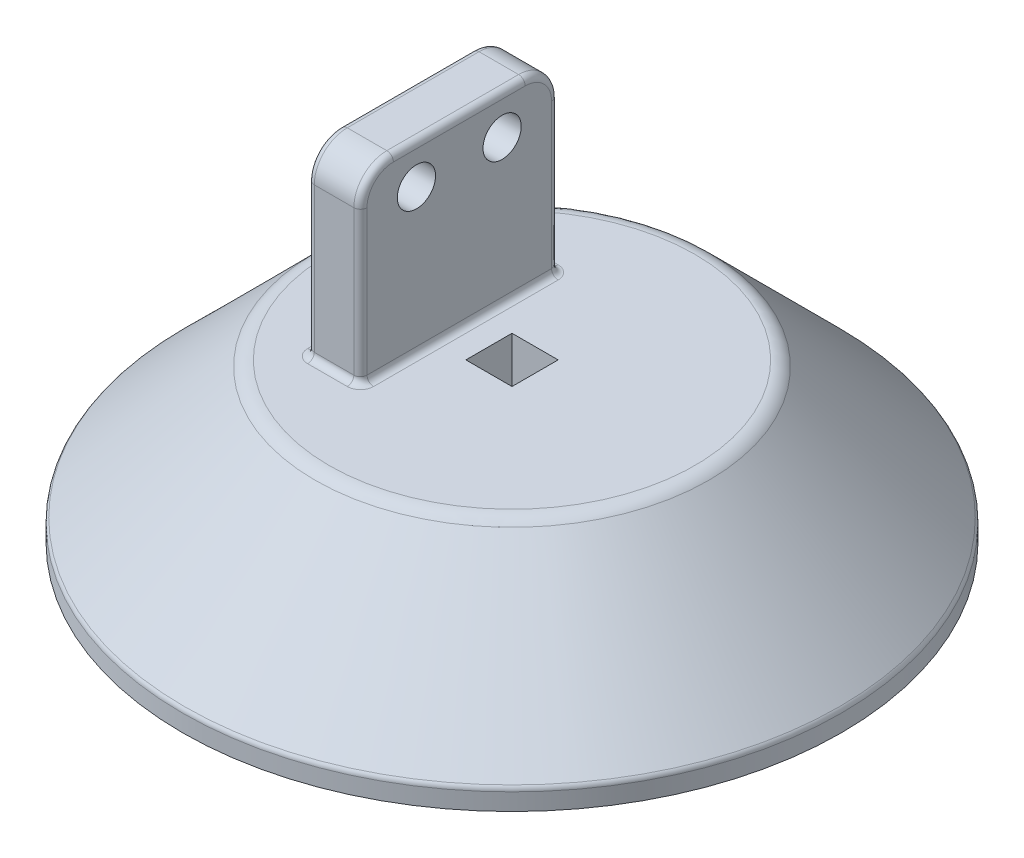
from build123d import *

# Parameters (mm, degrees)
SKETCH2_W           = 8
SKETCH2_H           = 30
BOSS_EXTRUDE1_DEPTH = 28
CUT_EXTRUDE1_REACH  = 89.772
SKETCH3_R           = 2.9
FILLET1_R           = 5
FILLET2_R           = 3
FILLET3_R           = 1
FILLET4_R           = 1
SKETCH4_W           = 7
SKETCH4_H           = 7
CUT_EXTRUDE2_DEPTH  = 20


with BuildPart() as part:
    # Sketch1 → Revolve1 (revolve)
    with BuildSketch(Plane.XY, mode=Mode.PRIVATE) as revolve1_sk:
        Polygon((0, 0), (0, 24), (-29, 24), (-50, 3), (-50, 0), align=None)
    revolve(revolve1_sk.sketch.rotate(Axis((0, 0, 0), (0, 1, 0)), 270), axis=Axis((0, 0, 0), (0, 1, 0)))

    # Sketch2 → Boss-Extrude1 (add)
    with BuildSketch(Plane(origin=(0, 24, 0), x_dir=(1, 0, 0), z_dir=(0, 1, 0))):
        with Locations((-12, 0)):
            Rectangle(SKETCH2_W, SKETCH2_H)
    extrude(amount=BOSS_EXTRUDE1_DEPTH)

    # Sketch3 → Cut-Extrude1 (cut, up to next)
    with BuildSketch(Plane(origin=(0, 0, 0), x_dir=(0, 0, -1), z_dir=(1, 0, 0)), mode=Mode.PRIVATE) as cut_extrude1_sk1:
        with Locations((-6.5, 46)):
            Circle(SKETCH3_R)
    cut_extrude1_tool1 = extrude(cut_extrude1_sk1.sketch, amount=-CUT_EXTRUDE1_REACH, mode=Mode.PRIVATE) & part.part
    # Sketch3 → Cut-Extrude1 (cut, up to next)
    with BuildSketch(Plane(origin=(0, 0, 0), x_dir=(0, 0, -1), z_dir=(1, 0, 0)), mode=Mode.PRIVATE) as cut_extrude1_sk2:
        with Locations((6.5, 46)):
            Circle(SKETCH3_R)
    cut_extrude1_tool2 = extrude(cut_extrude1_sk2.sketch, amount=-CUT_EXTRUDE1_REACH, mode=Mode.PRIVATE) & part.part
    add(cut_extrude1_tool1.solids().sort_by_distance((0, 46, 6.5))[0], mode=Mode.SUBTRACT)
    add(cut_extrude1_tool2.solids().sort_by_distance((0, 46, -6.5))[0], mode=Mode.SUBTRACT)

    # Fillet1
    fillet1_edges = [part.edges().sort_by_distance(p)[0] for p in [
        (-12, 52, 15),
        (-12, 52, -15),
    ]]
    fillet(fillet1_edges, radius=FILLET1_R)

    # Fillet2
    fillet2_edges = [part.edges().sort_by_distance(p)[0] for p in [
        (0, 24, 29),
    ]]
    fillet(fillet2_edges, radius=FILLET2_R)

    # Fillet3
    fillet3_edges = [part.edges().sort_by_distance(p)[0] for p in [
        (0, 3, 50),
    ]]
    fillet(fillet3_edges, radius=FILLET3_R)

    # Fillet4
    fillet4_edges = [part.edges().sort_by_distance(p)[0] for p in [
        (-16, 24, 0),
        (-12, 24, 15),
        (-8, 24, 0),
        (-12, 24, -15),
        (-16, 52, 0),
        (-8, 52, 0),
        (-16, 35.5, 15),
        (-16, 35.5, -15),
        (-16, 50.535533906, 13.535533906),
        (-16, 50.535533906, -13.535533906),
        (-8, 35.5, -15),
        (-8, 35.5, 15),
        (-8, 50.535533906, 13.535533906),
        (-8, 50.535533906, -13.535533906),
    ]]
    fillet(fillet4_edges, radius=FILLET4_R)

    # Sketch4 → Cut-Extrude2 (cut)
    with BuildSketch(Plane(origin=(0, 24, 0), x_dir=(1, 0, 0), z_dir=(0, 1, 0))):
        Rectangle(SKETCH4_W, SKETCH4_H)
    extrude(amount=-CUT_EXTRUDE2_DEPTH, mode=Mode.SUBTRACT)


solid = part.part
